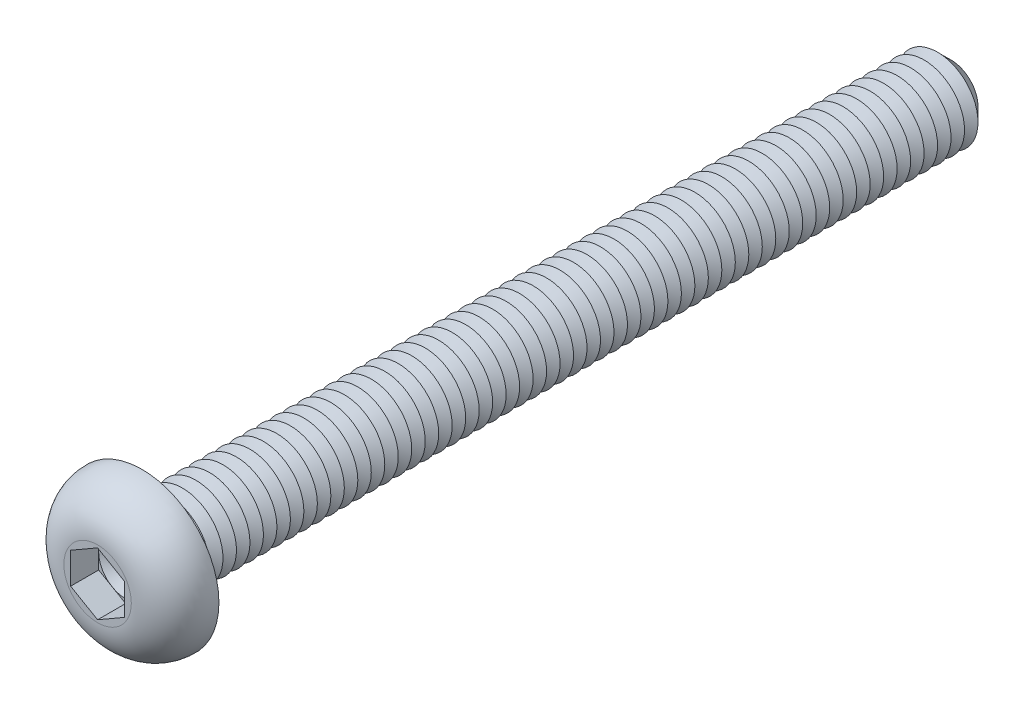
from build123d import *

# Parameters (mm, degrees)
CUT_EXTRUDE1_DEPTH  = 1.04
SKETCH4_R           = 1.5
BOSS_EXTRUDE1_DEPTH = 30
CHAMFER1_SIZE       = 0.5
LPATTERN1_COUNT     = 58
LPATTERN1_PITCH     = 0.5
FILLET2_R           = 0.2


with BuildPart() as part:
    # Sketch2 → Revolve1 (revolve)
    with BuildSketch(Plane(origin=(0, 0, 0), x_dir=(0, 0, -1), z_dir=(1, 0, 0)), mode=Mode.PRIVATE) as revolve1_sk:
        with BuildLine():
            Line((0, 0), (-1.65, 0))
            Line((-1.65, 0), (-1.65, 1.250781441))
            ThreePointArc((-1.65, 1.250781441), (-1.163552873, 2.39969397), (0, 2.85))
            Line((0, 2.85), (0, 0))
        make_face()
    revolve(revolve1_sk.sketch.rotate(Axis((0, 0, 47.934239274), (0, 0, -1)), 90), axis=Axis((0, 0, 47.934239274), (0, 0, -1)))

    # Sketch3 → Cut-Extrude1 (cut)
    with BuildSketch(Plane.XY.offset(1.65)):
        Polygon((0, 1.154700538), (-1, 0.577350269), (-1, -0.577350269), (0, -1.154700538), (1, -0.577350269), (1, 0.577350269), align=None)
    extrude(amount=-CUT_EXTRUDE1_DEPTH, mode=Mode.SUBTRACT)

    # Sketch4 → Boss-Extrude1 (add)
    with BuildSketch(Plane(origin=(0, 0, 0), x_dir=(-1, 0, 0), z_dir=(0, 0, -1))):
        with Locations(Location((0, 0, 0), (0, 0, 180))):
            Circle(SKETCH4_R)
    extrude(amount=BOSS_EXTRUDE1_DEPTH)

    # Chamfer1
    chamfer1_edges = [part.edges().sort_by_distance(p)[0] for p in [
        (-1.5, 0, -30),
    ]]
    chamfer(chamfer1_edges, length=CHAMFER1_SIZE)

    # Sketch5 → Cut-Revolve1 (revolve, cut)
    with BuildSketch(Plane(origin=(0, 0, 0), x_dir=(0, 0, -1), z_dir=(1, 0, 0)), mode=Mode.PRIVATE) as cut_revolve1_sk:
        Polygon((0.5, 1.5), (1, 1.5), (0.75, 1.066987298), align=None)
    cut_revolve1 = revolve(cut_revolve1_sk.sketch.rotate(Axis((0, 0, 47.934239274), (0, 0, -1)), 90), axis=Axis((0, 0, 47.934239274), (0, 0, -1)), mode=Mode.SUBTRACT)

    # LPattern1: Cut-Revolve1 ×58
    with Locations(*[(0, 0, -i * LPATTERN1_PITCH) for i in range(1, LPATTERN1_COUNT)]):
        add(cut_revolve1, mode=Mode.SUBTRACT)

    # Fillet2
    fillet2_edges = [part.edges().sort_by_distance(p)[0] for p in [
        (-1.5, 0, 0),
    ]]
    fillet(fillet2_edges, radius=FILLET2_R)

    # Cut-Extrude2 cone 1 section (on through the dimple's axis) → Cut-Extrude2 (revolve, cut)
    with BuildSketch(Plane(origin=(0, 0, 0.61), x_dir=(0, -1, 0), z_dir=(1, 0, 0))):
        Polygon((0, 0), (1, 0), (0, 0.577350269), align=None)
    revolve(axis=Axis((0, 0, 0.61), (0, 0, -1)), mode=Mode.SUBTRACT)


solid = part.part
